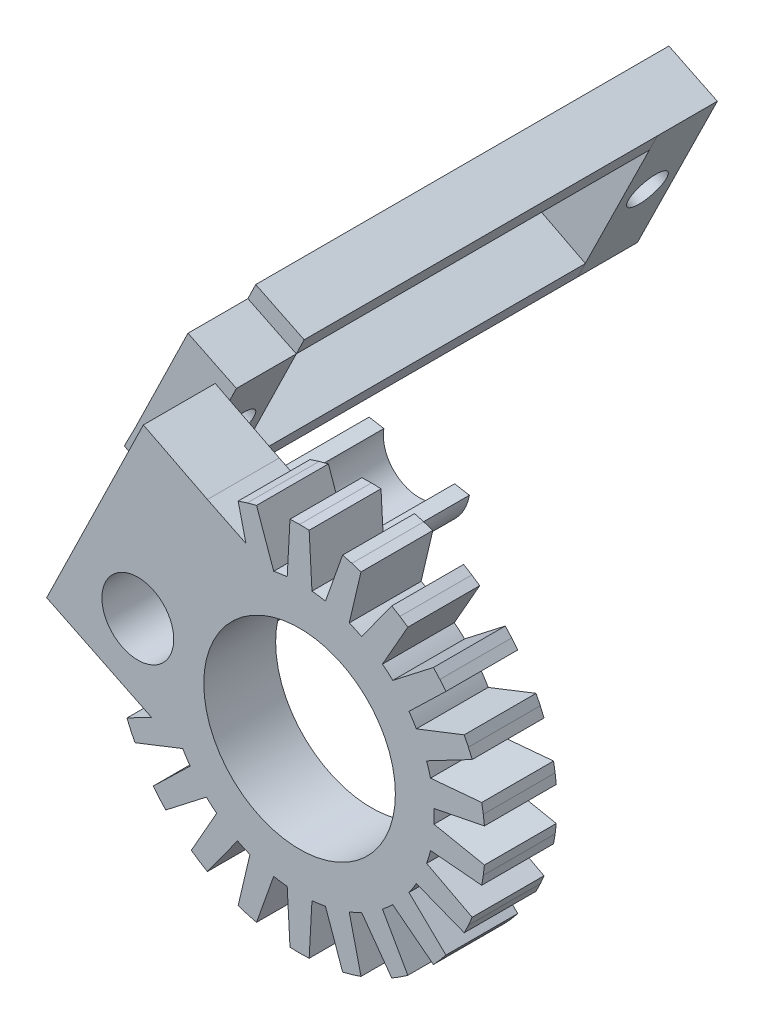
from build123d import *
from build123d.topology import SkipClean

# Parameters (mm, degrees)
SKETCH2_R             = 8
BOSS_EXTRUDE1_DEPTH   = 6
SKETCH3_R             = 3
CUT_EXTRUDE2_DEPTH    = 6
BOSS_EXTRUDE2_START   = 3.5
SKETCH4_R             = 4.25
SKETCH4_R_2           = 3
BOSS_EXTRUDE2_DEPTH   = 3.5
BOSS_EXTRUDE3_START   = 14
BOSS_EXTRUDE3_DEPTH   = 14
BOSS_EXTRUDE4_DEPTH   = 5
SKETCH7_R             = 1.6
CUT_EXTRUDE3_DEPTH    = 10
BOSS_EXTRUDE6_DEPTH   = 29.5
BOSS_EXTRUDE6_2_DEPTH = 29.5
BOSS_EXTRUDE7_DEPTH   = 5
SKETCH11_R            = 1.6
CUT_EXTRUDE4_DEPTH    = 5


with BuildPart() as part:
    # Sketch2 → Boss-Extrude1 (new body)
    with BuildSketch(Plane.XY):
        with BuildLine():
            Line((0, 15.5), (-0.799733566, 15.479354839))
            Line((-0.799733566, 15.479354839), (-1.033902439, 11.192347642))
            ThreePointArc((-1.033902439, 11.192347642), (-1.599618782, 11.125593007), (-2.161226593, 11.030262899))
            Line((-2.161226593, 11.030262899), (-3.593699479, 15.077643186))
            Line((-3.593699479, 15.077643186), (-4.366854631, 14.872141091))
            Line((-4.366854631, 14.872141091), (-5.128376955, 14.627021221))
            Line((-5.128376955, 14.627021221), (-4.483594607, 11.885958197))
            Line((-4.483594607, 11.885958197), (-7.695992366, 13.454430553))
            Line((-7.695992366, 13.454430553), (-13.044665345, 16.173198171))
            Line((-13.044665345, 16.173198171), (-21.118949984, -0.362029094))
            Line((-21.118949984, -0.362029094), (-15.72729801, -2.994535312))
            Line((-15.72729801, -2.994535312), (-12.372025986, -4.632766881))
            Line((-12.372025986, -4.632766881), (-14.412737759, -5.702893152))
            Line((-14.412737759, -5.702893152), (-14.099295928, -6.438932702))
            Line((-14.099295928, -6.438932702), (-13.748295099, -7.157819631))
            Line((-13.748295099, -7.157819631), (-9.751418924, -5.58993998))
            ThreePointArc((-9.751418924, -5.58993998), (-9.455689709, -6.076802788), (-9.135674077, -6.548057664))
            Line((-9.135674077, -6.548057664), (-12.222229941, -9.532423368))
            Line((-12.222229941, -9.532423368), (-11.714118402, -10.150341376))
            Line((-11.714118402, -10.150341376), (-11.17480172, -10.741219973))
            Line((-11.17480172, -10.741219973), (-7.781549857, -8.11080032))
            ThreePointArc((-7.781549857, -8.11080032), (-7.36063465, -8.494625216), (-6.920814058, -8.856632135))
            Line((-6.920814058, -8.856632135), (-9.041549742, -12.589693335))
            Line((-9.041549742, -12.589693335), (-8.379932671, -13.039429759))
            Line((-8.379932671, -13.039429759), (-7.695992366, -13.454430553))
            Line((-7.695992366, -13.454430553), (-5.181265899, -9.974571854))
            ThreePointArc((-5.181265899, -9.974571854), (-4.669264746, -10.224263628), (-4.145270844, -10.447694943))
            Line((-4.145270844, -10.447694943), (-5.128376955, -14.627021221))
            Line((-5.128376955, -14.627021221), (-4.366854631, -14.872141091))
            Line((-4.366854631, -14.872141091), (-3.593699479, -15.077643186))
            Line((-3.593699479, -15.077643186), (-2.161226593, -11.030262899))
            ThreePointArc((-2.161226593, -11.030262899), (-1.599618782, -11.125593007), (-1.033902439, -11.192347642))
            Line((-1.033902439, -11.192347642), (-0.799733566, -15.479354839))
            Line((-0.799733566, -15.479354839), (0, -15.5))
            Line((0, -15.5), (0.799733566, -15.479354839))
            Line((0.799733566, -15.479354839), (1.033902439, -11.192347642))
            ThreePointArc((1.033902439, -11.192347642), (1.599618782, -11.125593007), (2.161226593, -11.030262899))
            Line((2.161226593, -11.030262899), (3.593699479, -15.077643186))
            Line((3.593699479, -15.077643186), (4.366854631, -14.872141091))
            Line((4.366854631, -14.872141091), (5.128376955, -14.627021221))
            Line((5.128376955, -14.627021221), (4.145270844, -10.447694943))
            ThreePointArc((4.145270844, -10.447694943), (4.669264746, -10.224263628), (5.181265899, -9.974571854))
            Line((5.181265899, -9.974571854), (7.695992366, -13.454430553))
            Line((7.695992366, -13.454430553), (8.379932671, -13.039429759))
            Line((8.379932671, -13.039429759), (9.041549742, -12.589693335))
            Line((9.041549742, -12.589693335), (6.920814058, -8.856632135))
            ThreePointArc((6.920814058, -8.856632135), (7.36063465, -8.494625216), (7.781549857, -8.11080032))
            Line((7.781549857, -8.11080032), (11.17480172, -10.741219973))
            Line((11.17480172, -10.741219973), (11.714118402, -10.150341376))
            Line((11.714118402, -10.150341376), (12.222229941, -9.532423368))
            Line((12.222229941, -9.532423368), (9.135674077, -6.548057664))
            ThreePointArc((9.135674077, -6.548057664), (9.455689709, -6.076802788), (9.751418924, -5.58993998))
            Line((9.751418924, -5.58993998), (13.748295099, -7.157819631))
            Line((13.748295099, -7.157819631), (14.099295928, -6.438932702))
            Line((14.099295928, -6.438932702), (14.412737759, -5.702893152))
            Line((14.412737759, -5.702893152), (10.610416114, -3.708998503))
            ThreePointArc((10.610416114, -3.708998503), (10.784701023, -3.166673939), (10.931286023, -2.616215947))
            Line((10.931286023, -2.616215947), (15.207983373, -2.994535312))
            Line((15.207983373, -2.994535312), (15.342232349, -2.205879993))
            Line((15.342232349, -2.205879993), (15.435611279, -1.411348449))
            Line((15.435611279, -1.411348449), (11.22556534, -0.569458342))
            ThreePointArc((11.22556534, -0.569458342), (11.24, 0), (11.22556534, 0.569458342))
            Line((11.22556534, 0.569458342), (15.435611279, 1.411348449))
            Line((15.435611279, 1.411348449), (15.342232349, 2.205879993))
            Line((15.342232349, 2.205879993), (15.207983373, 2.994535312))
            Line((15.207983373, 2.994535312), (10.931286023, 2.616215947))
            ThreePointArc((10.931286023, 2.616215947), (10.784701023, 3.166673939), (10.610416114, 3.708998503))
            Line((10.610416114, 3.708998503), (14.412737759, 5.702893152))
            Line((14.412737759, 5.702893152), (14.099295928, 6.438932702))
            Line((14.099295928, 6.438932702), (13.748295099, 7.157819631))
            Line((13.748295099, 7.157819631), (9.751418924, 5.58993998))
            ThreePointArc((9.751418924, 5.58993998), (9.455689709, 6.076802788), (9.135674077, 6.548057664))
            Line((9.135674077, 6.548057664), (12.222229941, 9.532423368))
            Line((12.222229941, 9.532423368), (11.714118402, 10.150341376))
            Line((11.714118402, 10.150341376), (11.17480172, 10.741219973))
            Line((11.17480172, 10.741219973), (7.781549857, 8.11080032))
            ThreePointArc((7.781549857, 8.11080032), (7.36063465, 8.494625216), (6.920814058, 8.856632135))
            Line((6.920814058, 8.856632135), (9.041549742, 12.589693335))
            Line((9.041549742, 12.589693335), (8.379932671, 13.039429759))
            Line((8.379932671, 13.039429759), (7.695992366, 13.454430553))
            Line((7.695992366, 13.454430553), (5.181265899, 9.974571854))
            ThreePointArc((5.181265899, 9.974571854), (4.669264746, 10.224263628), (4.145270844, 10.447694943))
            Line((4.145270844, 10.447694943), (5.128376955, 14.627021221))
            Line((5.128376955, 14.627021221), (4.366854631, 14.872141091))
            Line((4.366854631, 14.872141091), (3.593699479, 15.077643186))
            Line((3.593699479, 15.077643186), (2.161226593, 11.030262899))
            ThreePointArc((2.161226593, 11.030262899), (1.599618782, 11.125593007), (1.033902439, 11.192347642))
            Line((1.033902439, 11.192347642), (0.799733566, 15.479354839))
            Line((0.799733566, 15.479354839), (0, 15.5))
        make_face()
        Circle(SKETCH2_R, mode=Mode.SUBTRACT)
    extrude(amount=BOSS_EXTRUDE1_DEPTH)

    # Sketch3 → Cut-Extrude2 (cut)
    with BuildSketch(Plane(origin=(0, 0, 0), x_dir=(-1, 0, 0), z_dir=(0, 0, -1))):
        with Locations((13.5060442, 1.932952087)):
            Circle(SKETCH3_R)
    extrude(amount=-CUT_EXTRUDE2_DEPTH, mode=Mode.SUBTRACT)

    # Sketch4 → Boss-Extrude2 (add)
    with BuildSketch(Plane(origin=(0, 0, 0), x_dir=(-1, 0, 0), z_dir=(0, 0, -1)).offset(BOSS_EXTRUDE2_START)):
        with Locations(Location((13.5060442, 1.932952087, 0), (0, 0, 180))):
            Circle(SKETCH4_R)
        with Locations((13.5060442, 1.932952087)):
            Circle(SKETCH4_R_2, mode=Mode.SUBTRACT)
    extrude(amount=-BOSS_EXTRUDE2_DEPTH)

    # Sketch5 → Boss-Extrude3 (add)
    with SkipClean():  # the faces are left unmerged after this step: merging them gives an invalid solid
        with BuildSketch(Plane(origin=(0, 0, -3.5), x_dir=(-1, 0, 0), z_dir=(0, 0, -1)).offset(BOSS_EXTRUDE3_START)):
            with BuildLine():
                Line((17.692198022, 2.666856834), (16.46097631, 2.451002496))
                ThreePointArc((16.46097631, 2.451002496), (14.02409461, -1.021980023), (10.55111209, 1.414901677))
                Line((10.55111209, 1.414901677), (9.319890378, 1.19904734))
                ThreePointArc((9.319890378, 1.19904734), (14.239948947, -2.253201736), (17.692198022, 2.666856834))
            make_face()
        extrude(amount=-BOSS_EXTRUDE3_DEPTH)

    # Sketch6 → Boss-Extrude4 (add)
    with SkipClean():  # the faces are left unmerged after this step: merging them gives an invalid solid
        with BuildSketch(Plane(origin=(0, 0, 0), x_dir=(-1, 0, 0), z_dir=(0, 0, -1))):
            Polygon((19.698903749, 9.679429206), (20.634203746, 7.854816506), (16.629218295, 5.801853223), (15.653828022, 7.707789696), (11.272406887, 16.696846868), (15.317482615, 18.668486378), align=None)
        extrude(amount=BOSS_EXTRUDE4_DEPTH)

    # Sketch7 → Cut-Extrude3 (cut)
    with SkipClean():  # the faces are left unmerged after this step: merging them gives an invalid solid
        with BuildSketch(Plane(origin=(-19.729562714, 9.61652834, 0), x_dir=(0, 0, 1), z_dir=(-0.8989057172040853, 0.43814211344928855, 0))):
            with Locations(Location((-2.5, 4.069974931, 0), (0, 0, 270))):
                Circle(SKETCH7_R)
        extrude(amount=-CUT_EXTRUDE3_DEPTH, mode=Mode.SUBTRACT)


with BuildPart() as body_2:
    # Sketch9 → Boss-Extrude6 (new body)
    with BuildSketch(Plane(origin=(0, 0, -5), x_dir=(-1, 0, 0), z_dir=(0, 0, -1))):
        Polygon((14.660269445, 20.016844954), (10.615193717, 18.045205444), (11.272406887, 16.696846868), (15.317482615, 18.668486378), align=None)
    extrude(amount=BOSS_EXTRUDE6_DEPTH)



with BuildPart() as body_3:
    # Sketch9 → Boss-Extrude6 2 (new body)
    with BuildSketch(Plane(origin=(0, 0, -5), x_dir=(-1, 0, 0), z_dir=(0, 0, -1))):
        Polygon((17.286114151, 4.494712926), (16.62953387, 5.802014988), (20.634203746, 7.854816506), (21.30742586, 6.514379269), align=None)
    extrude(amount=BOSS_EXTRUDE6_2_DEPTH)


with BuildPart() as body_2_1:
    add(body_2.part)

    add(body_3.part)  # Boss-Extrude7 merges body 3
    # Sketch10 → Boss-Extrude7 (add)
    with BuildSketch(Plane(origin=(0, 0, -34.5), x_dir=(-1, 0, 0), z_dir=(0, 0, -1))):
        Polygon((14.660269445, 20.016844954), (21.250262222, 6.628196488), (17.286114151, 4.494712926), (10.615193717, 18.045205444), align=None)
    extrude(amount=BOSS_EXTRUDE7_DEPTH)

    # Sketch11 → Cut-Extrude4 (cut)
    with BuildSketch(Plane(origin=(-15.695017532, 7.726672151, 0), x_dir=(0, 0, -1), z_dir=(0.8971730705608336, -0.4416791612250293, 0))):
        with Locations(Location((37, 3.940153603, 0), (0, 0, 90))):
            Circle(SKETCH11_R)
    extrude(amount=-CUT_EXTRUDE4_DEPTH, mode=Mode.SUBTRACT)


solid = Compound([part.part, body_2_1.part])
